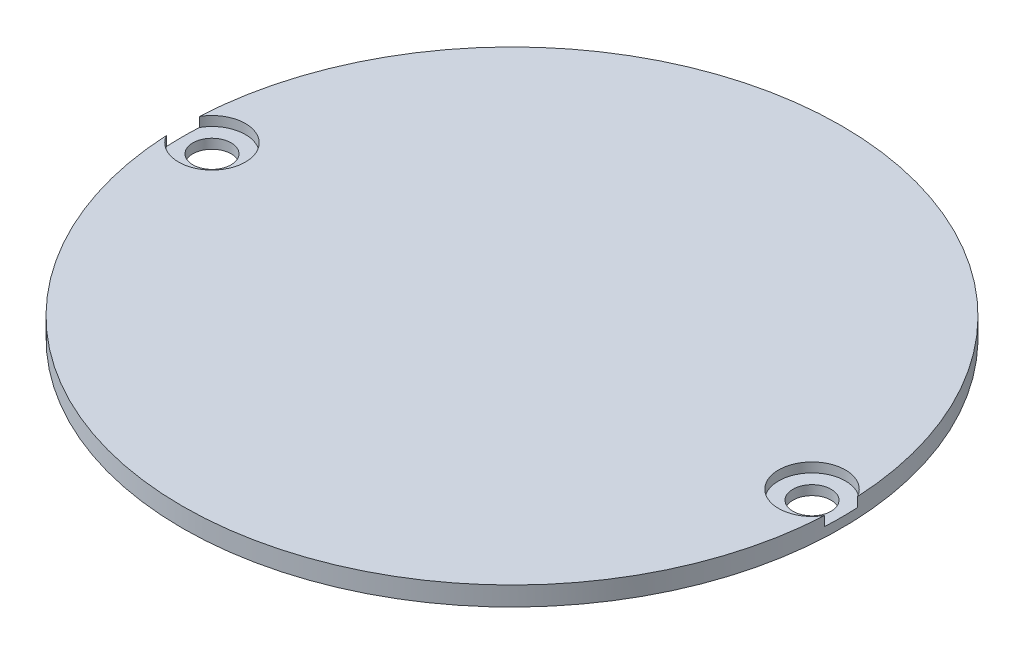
from build123d import *

# Parameters (mm, degrees)
SKETCH_1_W          = 34.5
SKETCH_1_H          = 2
SKETCH_2_R          = 2
CUT_EXTRUDE_1_DEPTH = 10
SKETCH_3_R          = 3.5
CUT_EXTRUDE_2_DEPTH = 1


with BuildPart() as part:
    # Sketch 1 → Revolve 1 (revolve)
    with BuildSketch(Plane.XY, mode=Mode.PRIVATE) as revolve_1_sk:
        with Locations((-17.25, 1)):
            Rectangle(SKETCH_1_W, SKETCH_1_H)
    revolve(revolve_1_sk.sketch.rotate(Axis((0, 0, 0), (0, 1, 0)), 270), axis=Axis((0, 0, 0), (0, 1, 0)))

    # Sketch 2 → Cut-Extrude 1 (cut)
    with BuildSketch(Plane(origin=(0, 2, 0), x_dir=(1, 0, 0), z_dir=(0, 1, 0))):
        with Locations(Location((-31.41, 0, 0), (0, 0, 270))):
            Circle(SKETCH_2_R)
        with Locations(Location((31.41, 0, 0), (0, 0, 90))):
            Circle(SKETCH_2_R)
    extrude(amount=-CUT_EXTRUDE_1_DEPTH, mode=Mode.SUBTRACT)

    # Sketch 3 → Cut-Extrude 2 (cut)
    with BuildSketch(Plane(origin=(0, 2, 0), x_dir=(1, 0, 0), z_dir=(0, 1, 0))):
        with Locations((-31.41, 0)):
            Circle(SKETCH_3_R)
        with Locations((31.41, 0)):
            Circle(SKETCH_3_R)
    extrude(amount=-CUT_EXTRUDE_2_DEPTH, mode=Mode.SUBTRACT)


solid = part.part
